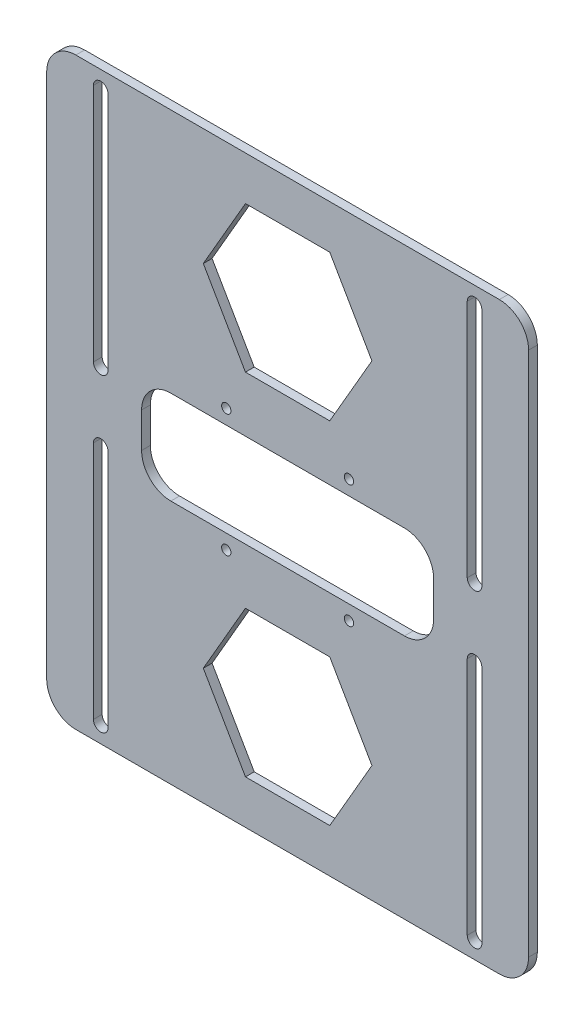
from build123d import *

# Parameters (mm, degrees)
SKETCH_1_W              = 165
SKETCH_1_H              = 200
EXTRUDE_1_DEPTH         = 3
HOLE_WIZARD_3_2_3_2_1_D = 3.2
SKETCH_5_W              = 100
SKETCH_5_H              = 32
CUT_EXTRUDE_3_DEPTH     = 3
FILLET_2_R              = 10
CUT_EXTRUDE_4_DEPTH     = 10
FILLET_3_R              = 10
CUT_EXTRUDE_5_DEPTH     = 10


with BuildPart() as part:
    # Sketch 1 → Extrude 1 (new body)
    with BuildSketch(Plane.XY):
        Rectangle(SKETCH_1_W, SKETCH_1_H)
    extrude(amount=EXTRUDE_1_DEPTH)

    # Hole Wizard 3.2 _3.2_ _1 (through all)
    with Locations(Plane.XY.offset(3)):
        with Locations((-21, 21), (-21, -21), (21, 21), (21, -21)):
            Hole(HOLE_WIZARD_3_2_3_2_1_D / 2)

    # Sketch 5 → Cut-Extrude 3 (cut)
    with BuildSketch(Plane.XY.offset(3)):
        Rectangle(SKETCH_5_W, SKETCH_5_H)
    extrude(amount=-CUT_EXTRUDE_3_DEPTH, mode=Mode.SUBTRACT)

    # Fillet 2
    fillet_2_edges = [part.edges().sort_by_distance(p)[0] for p in [
        (50, 16, 1.5),
        (50, -16, 1.5),
        (-50, -16, 1.5),
        (-50, 16, 1.5),
    ]]
    fillet(fillet_2_edges, radius=FILLET_2_R)

    # Sketch 4 → Cut-Extrude 4 (cut)
    with BuildSketch(Plane.XY.offset(3)):
        with BuildLine():
            Line((-61.5, 94), (-61.5, 12))
            ThreePointArc((-61.5, 12), (-64, 9.5), (-66.5, 12))
            Line((-66.5, 12), (-66.5, 94))
            ThreePointArc((-66.5, 94), (-64, 96.5), (-61.5, 94))
        make_face()
        with BuildLine():
            Line((66.5, 94), (66.5, 12))
            ThreePointArc((66.5, 12), (64, 9.5), (61.5, 12))
            Line((61.5, 12), (61.5, 94))
            ThreePointArc((61.5, 94), (64, 96.5), (66.5, 94))
        make_face()
    cut_extrude_4 = extrude(amount=-CUT_EXTRUDE_4_DEPTH, mode=Mode.SUBTRACT)

    # Fillet 3
    fillet_3_edges = [part.edges().sort_by_distance(p)[0] for p in [
        (82.5, -100, 1.5),
        (-82.5, -100, 1.5),
        (-82.5, 100, 1.5),
        (82.5, 100, 1.5),
    ]]
    fillet(fillet_3_edges, radius=FILLET_3_R)

    # Mirror 1: Cut-Extrude 4 across plane
    add(cut_extrude_4.mirror(Plane.ZX), mode=Mode.SUBTRACT)

    # Sketch 7 → Cut-Extrude 5 (cut)
    with BuildSketch(Plane.XY.offset(3)):
        Polygon((28.867512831, 59.993975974), (14.438973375, 84.996987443), (-14.428539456, 85.003011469), (-28.867512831, 60.006024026), (-14.438973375, 35.003012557), (14.428539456, 34.996988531), align=None)
        Polygon((28.867513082, -59.995330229), (14.4297124, -34.997665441), (-14.437800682, -35.002335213), (-28.867513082, -60.004669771), (-14.4297124, -85.002334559), (14.437800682, -84.997664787), align=None)
    extrude(amount=-CUT_EXTRUDE_5_DEPTH, mode=Mode.SUBTRACT)


solid = part.part
